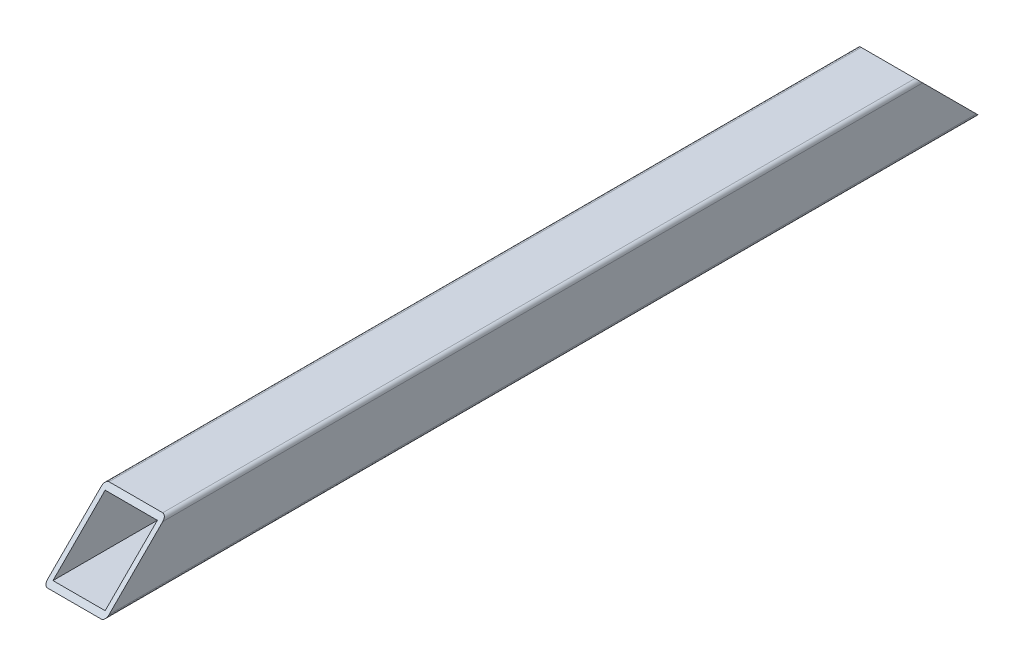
from build123d import *

# Parameters (mm, degrees)
ESQUISSE1_W             = 80
ESQUISSE1_H             = 80
ESQUISSE1_W_2           = 68
ESQUISSE1_H_2           = 68
EXTRU_MINCE1_DEPTH      = 1140
ENL_V_MAT_EXTRU_1_DEPTH = 1146.60027933
CONG_1_R                = 5


with BuildPart() as part:
    # Esquisse1 → Extru.-Mince1 (new body)
    with BuildSketch(Plane.XY):
        with Locations((40, -40)):
            Rectangle(ESQUISSE1_W, ESQUISSE1_H)
        with Locations((40, -40)):
            Rectangle(ESQUISSE1_W_2, ESQUISSE1_H_2, mode=Mode.SUBTRACT)
    extrude(amount=EXTRU_MINCE1_DEPTH)

    # Esquisse2 → Enl_v. mat.-Extru.1 (cut, through all)
    with BuildSketch(Plane(origin=(80, 0, 0), x_dir=(0, 0, -1), z_dir=(1, 0, 0))):
        Polygon((0, -80), (0, 0), (-80, 0), align=None)
        Polygon((-1140, -80), (-1060, 0), (-1140, 0), align=None)
    extrude(amount=-ENL_V_MAT_EXTRU_1_DEPTH, mode=Mode.SUBTRACT)

    # Cong_1
    cong_1_edges = [part.edges().sort_by_distance(p)[0] for p in [
        (80, 0, 570),
        (0, 0, 570),
        (80, -80, 570),
        (0, -80, 570),
    ]]
    fillet(cong_1_edges, radius=CONG_1_R)


solid = part.part
